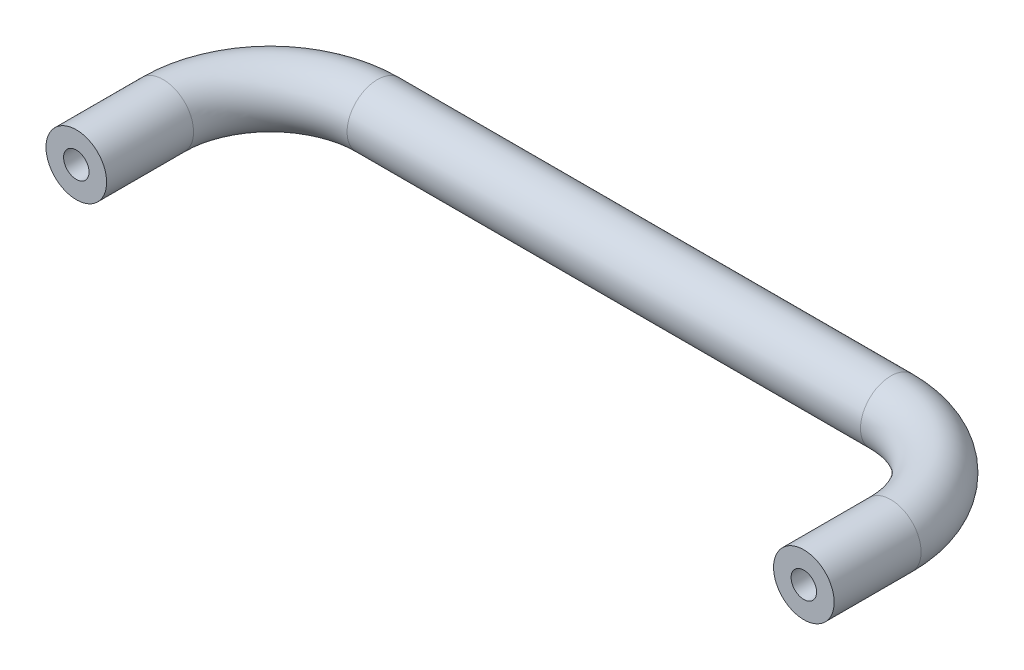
ISO-10303-21;
HEADER;
FILE_DESCRIPTION(('STEP AP214'),'2;1');
FILE_NAME('part.step','',(''),(''),'','','');
FILE_SCHEMA(('AUTOMOTIVE_DESIGN { 1 0 10303 214 1 1 1 1 }'));
ENDSEC;
DATA;
#1=APPLICATION_CONTEXT('core data for automotive mechanical design processes');
#2=APPLICATION_PROTOCOL_DEFINITION('international standard','automotive_design',2000,#1);
#3=PRODUCT_CONTEXT('',#1,'mechanical');
#4=PRODUCT('Part','Part','',(#3));
#5=PRODUCT_RELATED_PRODUCT_CATEGORY('part','',(#4));
#6=PRODUCT_DEFINITION_FORMATION('','',#4);
#7=PRODUCT_DEFINITION_CONTEXT('part definition',#1,'design');
#8=PRODUCT_DEFINITION('design','',#6,#7);
#9=PRODUCT_DEFINITION_SHAPE('','',#8);
#10=(LENGTH_UNIT() NAMED_UNIT(*) SI_UNIT(.MILLI.,.METRE.));
#11=(NAMED_UNIT(*) PLANE_ANGLE_UNIT() SI_UNIT($,.RADIAN.));
#12=(NAMED_UNIT(*) SI_UNIT($,.STERADIAN.) SOLID_ANGLE_UNIT());
#13=UNCERTAINTY_MEASURE_WITH_UNIT(LENGTH_MEASURE(1.E-05),#10,'distance_accuracy_value','');
#14=(GEOMETRIC_REPRESENTATION_CONTEXT(3) GLOBAL_UNCERTAINTY_ASSIGNED_CONTEXT((#13)) GLOBAL_UNIT_ASSIGNED_CONTEXT((#10,
#11,#12)) REPRESENTATION_CONTEXT('',''));
#15=CARTESIAN_POINT('',(0.,0.,0.));
#16=DIRECTION('',(0.,0.,1.));
#17=DIRECTION('',(1.,0.,0.));
#18=AXIS2_PLACEMENT_3D('',#15,#16,#17);
#19=CARTESIAN_POINT('',(-60.,0.,32.));
#20=DIRECTION('',(0.,0.,-1.));
#21=DIRECTION('',(-1.,0.,0.));
#22=AXIS2_PLACEMENT_3D('',#19,#20,#21);
#23=PLANE('',#22);
#24=CARTESIAN_POINT('',(-60.,0.,32.));
#25=DIRECTION('',(0.,0.,1.));
#26=DIRECTION('',(1.,0.,0.));
#27=AXIS2_PLACEMENT_3D('',#24,#25,#26);
#28=CIRCLE('',#27,2.09999999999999);
#29=CARTESIAN_POINT('',(-57.9,0.,32.));
#30=VERTEX_POINT('',#29);
#31=EDGE_CURVE('E71',#30,#30,#28,.T.);
#32=ORIENTED_EDGE('',*,*,#31,.F.);
#33=EDGE_LOOP('',(#32));
#34=FACE_BOUND('',#33,.T.);
#35=CARTESIAN_POINT('',(-60.,0.,32.));
#36=DIRECTION('',(0.,0.,-1.));
#37=DIRECTION('',(-1.,0.,0.));
#38=AXIS2_PLACEMENT_3D('',#35,#36,#37);
#39=CIRCLE('',#38,5.);
#40=CARTESIAN_POINT('',(-65.,0.,32.));
#41=VERTEX_POINT('',#40);
#42=EDGE_CURVE('E84',#41,#41,#39,.T.);
#43=ORIENTED_EDGE('',*,*,#42,.F.);
#44=EDGE_LOOP('',(#43));
#45=FACE_BOUND('',#44,.T.);
#46=ADVANCED_FACE('F45',(#34,#45),#23,.F.);
#47=CARTESIAN_POINT('',(60.,0.,32.));
#48=DIRECTION('',(0.,0.,1.));
#49=DIRECTION('',(1.,0.,0.));
#50=AXIS2_PLACEMENT_3D('',#47,#48,#49);
#51=PLANE('',#50);
#52=CARTESIAN_POINT('',(60.,0.,32.));
#53=DIRECTION('',(0.,0.,1.));
#54=DIRECTION('',(1.,0.,0.));
#55=AXIS2_PLACEMENT_3D('',#52,#53,#54);
#56=CIRCLE('',#55,2.09999999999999);
#57=CARTESIAN_POINT('',(62.1,0.,32.));
#58=VERTEX_POINT('',#57);
#59=EDGE_CURVE('E70',#58,#58,#56,.T.);
#60=ORIENTED_EDGE('',*,*,#59,.F.);
#61=EDGE_LOOP('',(#60));
#62=FACE_BOUND('',#61,.T.);
#63=CARTESIAN_POINT('',(60.,0.,32.));
#64=DIRECTION('',(0.,0.,1.));
#65=DIRECTION('',(1.,0.,0.));
#66=AXIS2_PLACEMENT_3D('',#63,#64,#65);
#67=CIRCLE('',#66,5.);
#68=CARTESIAN_POINT('',(65.,0.,32.));
#69=VERTEX_POINT('',#68);
#70=EDGE_CURVE('E11',#69,#69,#67,.T.);
#71=ORIENTED_EDGE('',*,*,#70,.T.);
#72=EDGE_LOOP('',(#71));
#73=FACE_BOUND('',#72,.T.);
#74=ADVANCED_FACE('F126',(#62,#73),#51,.T.);
#75=CARTESIAN_POINT('',(-60.,0.,32.));
#76=DIRECTION('',(0.,0.,-1.));
#77=DIRECTION('',(-1.,0.,0.));
#78=AXIS2_PLACEMENT_3D('',#75,#76,#77);
#79=CYLINDRICAL_SURFACE('',#78,5.);
#80=CARTESIAN_POINT('',(-60.,0.,17.6597353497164));
#81=DIRECTION('',(0.,0.,-1.));
#82=DIRECTION('',(-1.,0.,0.));
#83=AXIS2_PLACEMENT_3D('',#80,#81,#82);
#84=CIRCLE('',#83,5.);
#85=CARTESIAN_POINT('',(-64.9999999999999,0.,17.6597353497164));
#86=VERTEX_POINT('',#85);
#87=EDGE_CURVE('E88',#86,#86,#84,.T.);
#88=ORIENTED_EDGE('',*,*,#87,.F.);
#89=EDGE_LOOP('',(#88));
#90=FACE_BOUND('',#89,.T.);
#91=ORIENTED_EDGE('',*,*,#42,.T.);
#92=EDGE_LOOP('',(#91));
#93=FACE_BOUND('',#92,.T.);
#94=ADVANCED_FACE('F120',(#90,#93),#79,.T.);
#95=CARTESIAN_POINT('',(-42.3402646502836,0.,17.6597353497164));
#96=DIRECTION('',(0.,-1.,0.));
#97=DIRECTION('',(0.,0.,-1.));
#98=AXIS2_PLACEMENT_3D('',#95,#96,#97);
#99=TOROIDAL_SURFACE('',#98,17.6597353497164,5.);
#100=CARTESIAN_POINT('',(-42.3402646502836,0.,0.));
#101=DIRECTION('',(1.,0.,0.));
#102=DIRECTION('',(0.,0.,-1.));
#103=AXIS2_PLACEMENT_3D('',#100,#101,#102);
#104=CIRCLE('',#103,5.);
#105=CARTESIAN_POINT('',(-42.3402646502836,0.,-4.99999999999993));
#106=VERTEX_POINT('',#105);
#107=EDGE_CURVE('E92',#106,#106,#104,.T.);
#108=CARTESIAN_POINT('',(-42.3402646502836,0.,17.6597353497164));
#109=DIRECTION('',(0.,-1.,0.));
#110=DIRECTION('',(0.,0.,-1.));
#111=AXIS2_PLACEMENT_3D('',#108,#109,#110);
#112=CIRCLE('',#111,22.6597353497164);
#113=EDGE_CURVE('',#86,#106,#112,.T.);
#114=ORIENTED_EDGE('',*,*,#87,.T.);
#115=ORIENTED_EDGE('',*,*,#107,.F.);
#116=ORIENTED_EDGE('',*,*,#113,.T.);
#117=ORIENTED_EDGE('',*,*,#113,.F.);
#118=EDGE_LOOP('',(#114,#116,#115,#117));
#119=FACE_BOUND('',#118,.T.);
#120=ADVANCED_FACE('F114',(#119),#99,.T.);
#121=CARTESIAN_POINT('',(-42.3402646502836,0.,0.));
#122=DIRECTION('',(1.,0.,0.));
#123=DIRECTION('',(0.,0.,-1.));
#124=AXIS2_PLACEMENT_3D('',#121,#122,#123);
#125=CYLINDRICAL_SURFACE('',#124,5.);
#126=CARTESIAN_POINT('',(42.3402646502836,0.,0.));
#127=DIRECTION('',(1.,0.,0.));
#128=DIRECTION('',(0.,0.,-1.));
#129=AXIS2_PLACEMENT_3D('',#126,#127,#128);
#130=CIRCLE('',#129,5.);
#131=CARTESIAN_POINT('',(42.3402646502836,0.,-4.99999999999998));
#132=VERTEX_POINT('',#131);
#133=EDGE_CURVE('E96',#132,#132,#130,.T.);
#134=ORIENTED_EDGE('',*,*,#133,.F.);
#135=EDGE_LOOP('',(#134));
#136=FACE_BOUND('',#135,.T.);
#137=ORIENTED_EDGE('',*,*,#107,.T.);
#138=EDGE_LOOP('',(#137));
#139=FACE_BOUND('',#138,.T.);
#140=ADVANCED_FACE('F108',(#136,#139),#125,.T.);
#141=CARTESIAN_POINT('',(42.3402646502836,0.,17.6597353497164));
#142=DIRECTION('',(0.,-1.,0.));
#143=DIRECTION('',(0.,0.,-1.));
#144=AXIS2_PLACEMENT_3D('',#141,#142,#143);
#145=TOROIDAL_SURFACE('',#144,17.6597353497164,5.);
#146=CARTESIAN_POINT('',(60.,0.,17.6597353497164));
#147=DIRECTION('',(0.,0.,1.));
#148=DIRECTION('',(1.,0.,0.));
#149=AXIS2_PLACEMENT_3D('',#146,#147,#148);
#150=CIRCLE('',#149,5.);
#151=CARTESIAN_POINT('',(65.,0.,17.6597353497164));
#152=VERTEX_POINT('',#151);
#153=EDGE_CURVE('E53',#152,#152,#150,.T.);
#154=CARTESIAN_POINT('',(42.3402646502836,0.,17.6597353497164));
#155=DIRECTION('',(0.,-1.,0.));
#156=DIRECTION('',(0.,0.,-1.));
#157=AXIS2_PLACEMENT_3D('',#154,#155,#156);
#158=CIRCLE('',#157,22.6597353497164);
#159=EDGE_CURVE('',#132,#152,#158,.T.);
#160=ORIENTED_EDGE('',*,*,#133,.T.);
#161=ORIENTED_EDGE('',*,*,#153,.F.);
#162=ORIENTED_EDGE('',*,*,#159,.T.);
#163=ORIENTED_EDGE('',*,*,#159,.F.);
#164=EDGE_LOOP('',(#160,#162,#161,#163));
#165=FACE_BOUND('',#164,.T.);
#166=ADVANCED_FACE('F105',(#165),#145,.T.);
#167=CARTESIAN_POINT('',(60.,0.,17.6597353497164));
#168=DIRECTION('',(0.,0.,1.));
#169=DIRECTION('',(1.,0.,0.));
#170=AXIS2_PLACEMENT_3D('',#167,#168,#169);
#171=CYLINDRICAL_SURFACE('',#170,5.);
#172=ORIENTED_EDGE('',*,*,#70,.F.);
#173=EDGE_LOOP('',(#172));
#174=FACE_BOUND('',#173,.T.);
#175=ORIENTED_EDGE('',*,*,#153,.T.);
#176=EDGE_LOOP('',(#175));
#177=FACE_BOUND('',#176,.T.);
#178=ADVANCED_FACE('F103',(#174,#177),#171,.T.);
#179=CARTESIAN_POINT('',(60.,0.,17.));
#180=DIRECTION('',(0.,0.,1.));
#181=DIRECTION('',(1.,0.,0.));
#182=AXIS2_PLACEMENT_3D('',#179,#180,#181);
#183=CONICAL_SURFACE('',#182,2.09999999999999,1.02974425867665);
#184=CARTESIAN_POINT('',(60.,0.,15.7381927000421));
#185=VERTEX_POINT('',#184);
#186=VERTEX_LOOP('',#185);
#187=FACE_BOUND('',#186,.T.);
#188=CARTESIAN_POINT('',(60.,0.,17.));
#189=DIRECTION('',(0.,0.,1.));
#190=DIRECTION('',(1.,0.,0.));
#191=AXIS2_PLACEMENT_3D('',#188,#189,#190);
#192=CIRCLE('',#191,2.09999999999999);
#193=CARTESIAN_POINT('',(62.1,0.,17.));
#194=VERTEX_POINT('',#193);
#195=EDGE_CURVE('E76',#194,#194,#192,.T.);
#196=ORIENTED_EDGE('',*,*,#195,.T.);
#197=EDGE_LOOP('',(#196));
#198=FACE_BOUND('',#197,.T.);
#199=ADVANCED_FACE('F132',(#187,#198),#183,.F.);
#200=CARTESIAN_POINT('',(60.,0.,32.));
#201=DIRECTION('',(0.,0.,1.));
#202=DIRECTION('',(1.,0.,0.));
#203=AXIS2_PLACEMENT_3D('',#200,#201,#202);
#204=CYLINDRICAL_SURFACE('',#203,2.09999999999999);
#205=ORIENTED_EDGE('',*,*,#195,.F.);
#206=EDGE_LOOP('',(#205));
#207=FACE_BOUND('',#206,.T.);
#208=ORIENTED_EDGE('',*,*,#59,.T.);
#209=EDGE_LOOP('',(#208));
#210=FACE_BOUND('',#209,.T.);
#211=ADVANCED_FACE('F63',(#207,#210),#204,.F.);
#212=CARTESIAN_POINT('',(-60.,0.,17.));
#213=DIRECTION('',(0.,0.,1.));
#214=DIRECTION('',(1.,0.,0.));
#215=AXIS2_PLACEMENT_3D('',#212,#213,#214);
#216=CONICAL_SURFACE('',#215,2.09999999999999,1.02974425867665);
#217=CARTESIAN_POINT('',(-60.,0.,15.7381927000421));
#218=VERTEX_POINT('',#217);
#219=VERTEX_LOOP('',#218);
#220=FACE_BOUND('',#219,.T.);
#221=CARTESIAN_POINT('',(-60.,0.,17.));
#222=DIRECTION('',(0.,0.,1.));
#223=DIRECTION('',(1.,0.,0.));
#224=AXIS2_PLACEMENT_3D('',#221,#222,#223);
#225=CIRCLE('',#224,2.09999999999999);
#226=CARTESIAN_POINT('',(-57.9,0.,17.));
#227=VERTEX_POINT('',#226);
#228=EDGE_CURVE('E67',#227,#227,#225,.T.);
#229=ORIENTED_EDGE('',*,*,#228,.T.);
#230=EDGE_LOOP('',(#229));
#231=FACE_BOUND('',#230,.T.);
#232=ADVANCED_FACE('F59',(#220,#231),#216,.F.);
#233=CARTESIAN_POINT('',(-60.,0.,32.));
#234=DIRECTION('',(0.,0.,1.));
#235=DIRECTION('',(1.,0.,0.));
#236=AXIS2_PLACEMENT_3D('',#233,#234,#235);
#237=CYLINDRICAL_SURFACE('',#236,2.09999999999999);
#238=ORIENTED_EDGE('',*,*,#228,.F.);
#239=EDGE_LOOP('',(#238));
#240=FACE_BOUND('',#239,.T.);
#241=ORIENTED_EDGE('',*,*,#31,.T.);
#242=EDGE_LOOP('',(#241));
#243=FACE_BOUND('',#242,.T.);
#244=ADVANCED_FACE('F62',(#240,#243),#237,.F.);
#245=CLOSED_SHELL('',(#46,#74,#94,#120,#140,#166,#178,#199,#211,#232,#244));
#246=MANIFOLD_SOLID_BREP('B2',#245);
#247=ADVANCED_BREP_SHAPE_REPRESENTATION('',(#18,#246),#14);
#248=SHAPE_DEFINITION_REPRESENTATION(#9,#247);
ENDSEC;
END-ISO-10303-21;
